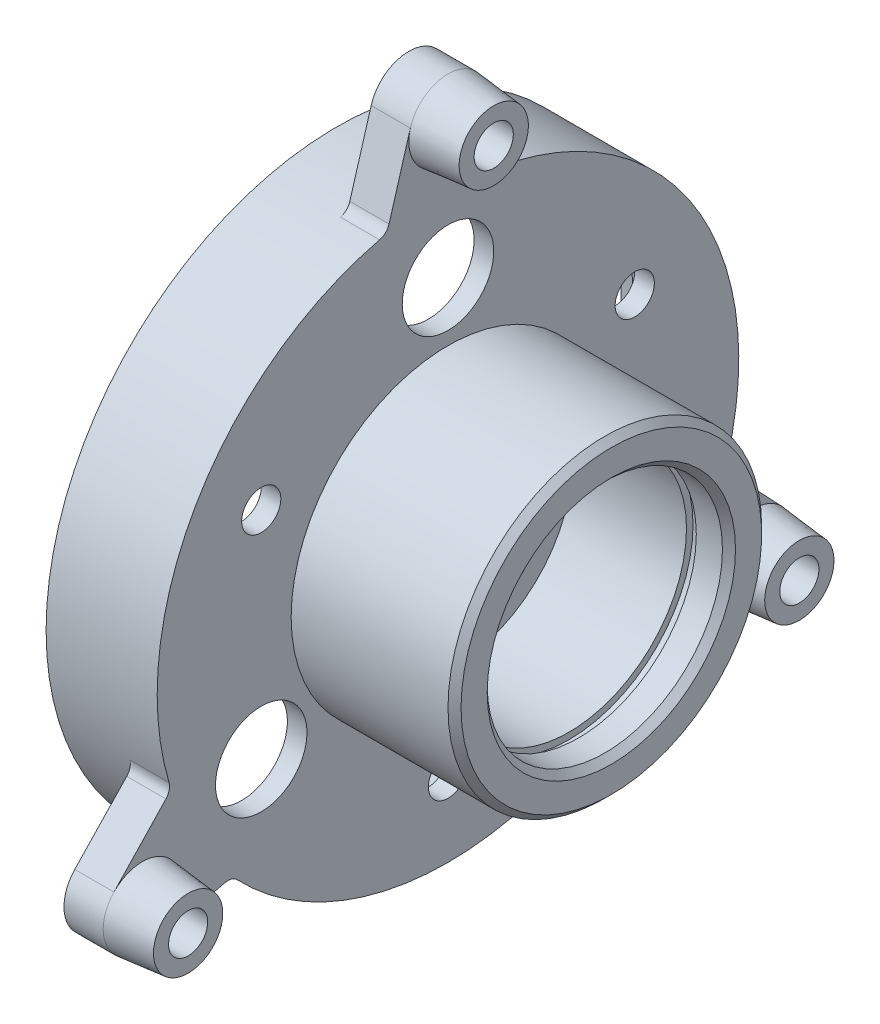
ISO-10303-21;
HEADER;
FILE_DESCRIPTION(('STEP AP214'),'2;1');
FILE_NAME('part.step','',(''),(''),'','','');
FILE_SCHEMA(('AUTOMOTIVE_DESIGN { 1 0 10303 214 1 1 1 1 }'));
ENDSEC;
DATA;
#1=APPLICATION_CONTEXT('core data for automotive mechanical design processes');
#2=APPLICATION_PROTOCOL_DEFINITION('international standard','automotive_design',2000,#1);
#3=PRODUCT_CONTEXT('',#1,'mechanical');
#4=PRODUCT('Part','Part','',(#3));
#5=PRODUCT_RELATED_PRODUCT_CATEGORY('part','',(#4));
#6=PRODUCT_DEFINITION_FORMATION('','',#4);
#7=PRODUCT_DEFINITION_CONTEXT('part definition',#1,'design');
#8=PRODUCT_DEFINITION('design','',#6,#7);
#9=PRODUCT_DEFINITION_SHAPE('','',#8);
#10=(LENGTH_UNIT() NAMED_UNIT(*) SI_UNIT(.MILLI.,.METRE.));
#11=(NAMED_UNIT(*) PLANE_ANGLE_UNIT() SI_UNIT($,.RADIAN.));
#12=(NAMED_UNIT(*) SI_UNIT($,.STERADIAN.) SOLID_ANGLE_UNIT());
#13=UNCERTAINTY_MEASURE_WITH_UNIT(LENGTH_MEASURE(1.E-05),#10,'distance_accuracy_value','');
#14=(GEOMETRIC_REPRESENTATION_CONTEXT(3) GLOBAL_UNCERTAINTY_ASSIGNED_CONTEXT((#13)) GLOBAL_UNIT_ASSIGNED_CONTEXT((#10,
#11,#12)) REPRESENTATION_CONTEXT('',''));
#15=CARTESIAN_POINT('',(0.,0.,0.));
#16=DIRECTION('',(0.,0.,1.));
#17=DIRECTION('',(1.,0.,0.));
#18=AXIS2_PLACEMENT_3D('',#15,#16,#17);
#19=CARTESIAN_POINT('',(42.,0.,0.));
#20=DIRECTION('',(-1.,0.,0.));
#21=DIRECTION('',(0.,0.,1.));
#22=AXIS2_PLACEMENT_3D('',#19,#20,#21);
#23=CYLINDRICAL_SURFACE('',#22,18.);
#24=CARTESIAN_POINT('',(18.,0.,0.));
#25=DIRECTION('',(-1.,0.,0.));
#26=DIRECTION('',(0.,0.,1.));
#27=AXIS2_PLACEMENT_3D('',#24,#25,#26);
#28=CIRCLE('',#27,18.);
#29=CARTESIAN_POINT('',(18.,0.,18.));
#30=VERTEX_POINT('',#29);
#31=EDGE_CURVE('E338',#30,#30,#28,.T.);
#32=ORIENTED_EDGE('',*,*,#31,.T.);
#33=EDGE_LOOP('',(#32));
#34=FACE_BOUND('',#33,.T.);
#35=CARTESIAN_POINT('',(35.5,0.,0.));
#36=DIRECTION('',(1.,0.,0.));
#37=DIRECTION('',(0.,0.,-1.));
#38=AXIS2_PLACEMENT_3D('',#35,#36,#37);
#39=CIRCLE('',#38,18.);
#40=CARTESIAN_POINT('',(35.5,0.,-18.));
#41=VERTEX_POINT('',#40);
#42=EDGE_CURVE('E31',#41,#41,#39,.F.);
#43=ORIENTED_EDGE('',*,*,#42,.F.);
#44=EDGE_LOOP('',(#43));
#45=FACE_BOUND('',#44,.T.);
#46=ADVANCED_FACE('F27',(#34,#45),#23,.F.);
#47=CARTESIAN_POINT('',(14.,0.,0.));
#48=DIRECTION('',(-1.,0.,0.));
#49=DIRECTION('',(0.,0.,1.));
#50=AXIS2_PLACEMENT_3D('',#47,#48,#49);
#51=CYLINDRICAL_SURFACE('',#50,42.5);
#52=CARTESIAN_POINT('',(14.,0.,0.));
#53=DIRECTION('',(-1.,0.,0.));
#54=DIRECTION('',(0.,0.,1.));
#55=AXIS2_PLACEMENT_3D('',#52,#53,#54);
#56=CIRCLE('',#55,42.5);
#57=CARTESIAN_POINT('',(14.,0.,42.5));
#58=VERTEX_POINT('',#57);
#59=EDGE_CURVE('E404',#58,#58,#56,.T.);
#60=ORIENTED_EDGE('',*,*,#59,.F.);
#61=EDGE_LOOP('',(#60));
#62=FACE_BOUND('',#61,.T.);
#63=CARTESIAN_POINT('',(3.,0.,0.));
#64=DIRECTION('',(-1.,0.,0.));
#65=DIRECTION('',(0.,0.,1.));
#66=AXIS2_PLACEMENT_3D('',#63,#64,#65);
#67=CIRCLE('',#66,42.5);
#68=CARTESIAN_POINT('',(3.,0.,42.5));
#69=VERTEX_POINT('',#68);
#70=EDGE_CURVE('E335',#69,#69,#67,.F.);
#71=ORIENTED_EDGE('',*,*,#70,.F.);
#72=EDGE_LOOP('',(#71));
#73=FACE_BOUND('',#72,.T.);
#74=ADVANCED_FACE('F485',(#62,#73),#51,.F.);
#75=CARTESIAN_POINT('',(17.,44.5,0.));
#76=DIRECTION('',(-1.,0.,0.));
#77=DIRECTION('',(0.,0.,1.));
#78=AXIS2_PLACEMENT_3D('',#75,#76,#77);
#79=PLANE('',#78);
#80=CARTESIAN_POINT('',(17.,16.4999999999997,28.5788383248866));
#81=DIRECTION('',(-1.,0.,0.));
#82=DIRECTION('',(0.,0.,1.));
#83=AXIS2_PLACEMENT_3D('',#80,#81,#82);
#84=CIRCLE('',#83,3.);
#85=CARTESIAN_POINT('',(17.,16.4999999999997,31.5788383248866));
#86=VERTEX_POINT('',#85);
#87=EDGE_CURVE('E358',#86,#86,#84,.T.);
#88=ORIENTED_EDGE('',*,*,#87,.T.);
#89=EDGE_LOOP('',(#88));
#90=FACE_BOUND('',#89,.T.);
#91=CARTESIAN_POINT('',(17.,-16.4999999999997,-28.5788383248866));
#92=DIRECTION('',(-1.,0.,0.));
#93=DIRECTION('',(0.,0.,1.));
#94=AXIS2_PLACEMENT_3D('',#91,#92,#93);
#95=CIRCLE('',#94,7.);
#96=CARTESIAN_POINT('',(17.,-16.4999999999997,-21.5788383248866));
#97=VERTEX_POINT('',#96);
#98=EDGE_CURVE('E364',#97,#97,#95,.T.);
#99=ORIENTED_EDGE('',*,*,#98,.T.);
#100=EDGE_LOOP('',(#99));
#101=FACE_BOUND('',#100,.T.);
#102=CARTESIAN_POINT('',(17.,16.5000000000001,-28.5788383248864));
#103=DIRECTION('',(-1.,0.,0.));
#104=DIRECTION('',(0.,0.,1.));
#105=AXIS2_PLACEMENT_3D('',#102,#103,#104);
#106=CIRCLE('',#105,3.);
#107=CARTESIAN_POINT('',(17.,16.5000000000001,-25.5788383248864));
#108=VERTEX_POINT('',#107);
#109=EDGE_CURVE('E370',#108,#108,#106,.T.);
#110=ORIENTED_EDGE('',*,*,#109,.T.);
#111=EDGE_LOOP('',(#110));
#112=FACE_BOUND('',#111,.T.);
#113=CARTESIAN_POINT('',(17.,-16.5000000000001,28.5788383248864));
#114=DIRECTION('',(-1.,0.,0.));
#115=DIRECTION('',(0.,0.,1.));
#116=AXIS2_PLACEMENT_3D('',#113,#114,#115);
#117=CIRCLE('',#116,7.);
#118=CARTESIAN_POINT('',(17.,-16.5000000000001,35.5788383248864));
#119=VERTEX_POINT('',#118);
#120=EDGE_CURVE('E376',#119,#119,#117,.T.);
#121=ORIENTED_EDGE('',*,*,#120,.T.);
#122=EDGE_LOOP('',(#121));
#123=FACE_BOUND('',#122,.T.);
#124=CARTESIAN_POINT('',(17.,-33.,0.));
#125=DIRECTION('',(-1.,0.,0.));
#126=DIRECTION('',(0.,0.,1.));
#127=AXIS2_PLACEMENT_3D('',#124,#125,#126);
#128=CIRCLE('',#127,3.);
#129=CARTESIAN_POINT('',(17.,-33.,3.));
#130=VERTEX_POINT('',#129);
#131=EDGE_CURVE('E382',#130,#130,#128,.T.);
#132=ORIENTED_EDGE('',*,*,#131,.T.);
#133=EDGE_LOOP('',(#132));
#134=FACE_BOUND('',#133,.T.);
#135=CARTESIAN_POINT('',(17.,33.,0.));
#136=DIRECTION('',(-1.,0.,0.));
#137=DIRECTION('',(0.,0.,1.));
#138=AXIS2_PLACEMENT_3D('',#135,#136,#137);
#139=CIRCLE('',#138,7.);
#140=CARTESIAN_POINT('',(17.,33.,7.));
#141=VERTEX_POINT('',#140);
#142=EDGE_CURVE('E388',#141,#141,#139,.T.);
#143=ORIENTED_EDGE('',*,*,#142,.T.);
#144=EDGE_LOOP('',(#143));
#145=FACE_BOUND('',#144,.T.);
#146=CARTESIAN_POINT('',(17.,0.,0.));
#147=DIRECTION('',(-1.,0.,0.));
#148=DIRECTION('',(0.,0.,1.));
#149=AXIS2_PLACEMENT_3D('',#146,#147,#148);
#150=CIRCLE('',#149,24.);
#151=CARTESIAN_POINT('',(17.,0.,24.));
#152=VERTEX_POINT('',#151);
#153=EDGE_CURVE('E254',#152,#152,#150,.T.);
#154=ORIENTED_EDGE('',*,*,#153,.T.);
#155=EDGE_LOOP('',(#154));
#156=FACE_BOUND('',#155,.T.);
#157=CARTESIAN_POINT('',(17.,-26.9999999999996,-46.7653718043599));
#158=DIRECTION('',(-1.,0.,0.));
#159=DIRECTION('',(0.,0.866025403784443,-0.499999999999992));
#160=AXIS2_PLACEMENT_3D('',#157,#158,#159);
#161=CIRCLE('',#160,6.);
#162=CARTESIAN_POINT('',(17.,-32.8327416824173,-45.3585582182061));
#163=VERTEX_POINT('',#162);
#164=CARTESIAN_POINT('',(17.,-22.8652928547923,-51.113267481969));
#165=VERTEX_POINT('',#164);
#166=EDGE_CURVE('E178',#163,#165,#161,.T.);
#167=ORIENTED_EDGE('',*,*,#166,.T.);
#168=DIRECTION('',(0.,0.724649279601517,0.689117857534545));
#169=VECTOR('',#168,1.);
#170=CARTESIAN_POINT('',(17.,-22.8652928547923,-51.113267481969));
#171=LINE('',#170,#169);
#172=CARTESIAN_POINT('',(17.,-14.5022067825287,-43.1602450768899));
#173=VERTEX_POINT('',#172);
#174=EDGE_CURVE('E153',#165,#173,#171,.T.);
#175=ORIENTED_EDGE('',*,*,#174,.T.);
#176=CARTESIAN_POINT('',(17.,-13.1239710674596,-44.609543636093));
#177=DIRECTION('',(-1.,0.,0.));
#178=DIRECTION('',(0.,0.,1.));
#179=AXIS2_PLACEMENT_3D('',#176,#177,#178);
#180=CIRCLE('',#179,2.);
#181=CARTESIAN_POINT('',(17.,-12.5594991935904,-42.6908535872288));
#182=VERTEX_POINT('',#181);
#183=EDGE_CURVE('E323',#173,#182,#180,.T.);
#184=ORIENTED_EDGE('',*,*,#183,.T.);
#185=CARTESIAN_POINT('',(17.,0.,0.));
#186=DIRECTION('',(-1.,0.,0.));
#187=DIRECTION('',(0.,0.,1.));
#188=AXIS2_PLACEMENT_3D('',#185,#186,#187);
#189=CIRCLE('',#188,44.5);
#190=CARTESIAN_POINT('',(17.,43.2511133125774,-10.4685814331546));
#191=VERTEX_POINT('',#190);
#192=EDGE_CURVE('E260',#191,#182,#189,.T.);
#193=ORIENTED_EDGE('',*,*,#192,.F.);
#194=CARTESIAN_POINT('',(17.,45.1949835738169,-10.9390794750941));
#195=DIRECTION('',(-1.,0.,0.));
#196=DIRECTION('',(0.,0.,1.));
#197=AXIS2_PLACEMENT_3D('',#194,#195,#196);
#198=CIRCLE('',#197,2.);
#199=CARTESIAN_POINT('',(17.,44.6289720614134,-9.02084305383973));
#200=VERTEX_POINT('',#199);
#201=EDGE_CURVE('E284',#191,#200,#198,.T.);
#202=ORIENTED_EDGE('',*,*,#201,.T.);
#203=DIRECTION('',(0.,0.959118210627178,0.283005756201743));
#204=VECTOR('',#203,1.);
#205=CARTESIAN_POINT('',(17.,55.6980345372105,-5.75470926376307));
#206=LINE('',#205,#204);
#207=CARTESIAN_POINT('',(17.,55.6980345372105,-5.75470926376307));
#208=VERTEX_POINT('',#207);
#209=EDGE_CURVE('E240',#200,#208,#206,.T.);
#210=ORIENTED_EDGE('',*,*,#209,.T.);
#211=CARTESIAN_POINT('',(17.,54.,0.));
#212=DIRECTION('',(-1.,0.,0.));
#213=DIRECTION('',(0.,0.,1.));
#214=AXIS2_PLACEMENT_3D('',#211,#212,#213);
#215=CIRCLE('',#214,6.);
#216=CARTESIAN_POINT('',(17.,55.6980345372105,5.75470926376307));
#217=VERTEX_POINT('',#216);
#218=EDGE_CURVE('E228',#208,#217,#215,.T.);
#219=ORIENTED_EDGE('',*,*,#218,.T.);
#220=DIRECTION('',(0.,-0.959118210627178,0.283005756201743));
#221=VECTOR('',#220,1.);
#222=CARTESIAN_POINT('',(17.,55.6980345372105,5.75470926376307));
#223=LINE('',#222,#221);
#224=CARTESIAN_POINT('',(17.,44.6289720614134,9.02084305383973));
#225=VERTEX_POINT('',#224);
#226=EDGE_CURVE('E237',#217,#225,#223,.T.);
#227=ORIENTED_EDGE('',*,*,#226,.T.);
#228=CARTESIAN_POINT('',(17.,45.1949835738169,10.9390794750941));
#229=DIRECTION('',(-1.,0.,0.));
#230=DIRECTION('',(0.,0.,1.));
#231=AXIS2_PLACEMENT_3D('',#228,#229,#230);
#232=CIRCLE('',#231,2.);
#233=CARTESIAN_POINT('',(17.,43.2511133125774,10.4685814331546));
#234=VERTEX_POINT('',#233);
#235=EDGE_CURVE('E281',#225,#234,#232,.T.);
#236=ORIENTED_EDGE('',*,*,#235,.T.);
#237=CARTESIAN_POINT('',(17.,-12.559499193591,42.6908535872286));
#238=VERTEX_POINT('',#237);
#239=EDGE_CURVE('E259',#238,#234,#189,.T.);
#240=ORIENTED_EDGE('',*,*,#239,.F.);
#241=CARTESIAN_POINT('',(17.,-13.1239710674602,44.6095436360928));
#242=DIRECTION('',(-1.,0.,0.));
#243=DIRECTION('',(0.,0.,1.));
#244=AXIS2_PLACEMENT_3D('',#241,#242,#243);
#245=CIRCLE('',#244,2.);
#246=CARTESIAN_POINT('',(17.,-14.5022067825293,43.1602450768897));
#247=VERTEX_POINT('',#246);
#248=EDGE_CURVE('E308',#238,#247,#245,.T.);
#249=ORIENTED_EDGE('',*,*,#248,.T.);
#250=DIRECTION('',(0.,-0.724649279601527,0.689117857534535));
#251=VECTOR('',#250,1.);
#252=CARTESIAN_POINT('',(17.,-22.865292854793,51.1132674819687));
#253=LINE('',#252,#251);
#254=CARTESIAN_POINT('',(17.,-22.865292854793,51.1132674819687));
#255=VERTEX_POINT('',#254);
#256=EDGE_CURVE('E206',#247,#255,#253,.T.);
#257=ORIENTED_EDGE('',*,*,#256,.T.);
#258=CARTESIAN_POINT('',(17.,-27.0000000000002,46.7653718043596));
#259=DIRECTION('',(-1.,0.,0.));
#260=DIRECTION('',(0.,-0.866025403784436,-0.500000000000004));
#261=AXIS2_PLACEMENT_3D('',#258,#259,#260);
#262=CIRCLE('',#261,6.);
#263=CARTESIAN_POINT('',(17.,-32.8327416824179,45.3585582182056));
#264=VERTEX_POINT('',#263);
#265=EDGE_CURVE('E190',#255,#264,#262,.T.);
#266=ORIENTED_EDGE('',*,*,#265,.T.);
#267=DIRECTION('',(0.,0.234468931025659,-0.972123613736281));
#268=VECTOR('',#267,1.);
#269=CARTESIAN_POINT('',(17.,-32.8327416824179,45.3585582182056));
#270=LINE('',#269,#268);
#271=CARTESIAN_POINT('',(17.,-30.1267652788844,34.1394020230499));
#272=VERTEX_POINT('',#271);
#273=EDGE_CURVE('E203',#264,#272,#270,.T.);
#274=ORIENTED_EDGE('',*,*,#273,.T.);
#275=CARTESIAN_POINT('',(17.,-32.071012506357,33.6704641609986));
#276=DIRECTION('',(-1.,0.,0.));
#277=DIRECTION('',(0.,0.,1.));
#278=AXIS2_PLACEMENT_3D('',#275,#276,#277);
#279=CIRCLE('',#278,2.);
#280=CARTESIAN_POINT('',(17.,-30.6916141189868,32.2222721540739));
#281=VERTEX_POINT('',#280);
#282=EDGE_CURVE('E305',#272,#281,#279,.T.);
#283=ORIENTED_EDGE('',*,*,#282,.T.);
#284=CARTESIAN_POINT('',(17.,-30.6916141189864,-32.2222721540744));
#285=VERTEX_POINT('',#284);
#286=EDGE_CURVE('E264',#285,#281,#189,.T.);
#287=ORIENTED_EDGE('',*,*,#286,.F.);
#288=CARTESIAN_POINT('',(17.,-32.0710125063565,-33.6704641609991));
#289=DIRECTION('',(-1.,0.,0.));
#290=DIRECTION('',(0.,0.,1.));
#291=AXIS2_PLACEMENT_3D('',#288,#289,#290);
#292=CIRCLE('',#291,2.);
#293=CARTESIAN_POINT('',(17.,-30.126765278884,-34.1394020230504));
#294=VERTEX_POINT('',#293);
#295=EDGE_CURVE('E44',#285,#294,#292,.T.);
#296=ORIENTED_EDGE('',*,*,#295,.T.);
#297=DIRECTION('',(0.,-0.234468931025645,-0.972123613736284));
#298=VECTOR('',#297,1.);
#299=CARTESIAN_POINT('',(17.,-32.8327416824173,-45.3585582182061));
#300=LINE('',#299,#298);
#301=EDGE_CURVE('E163',#294,#163,#300,.T.);
#302=ORIENTED_EDGE('',*,*,#301,.T.);
#303=EDGE_LOOP('',(#167,#175,#184,#193,#202,#210,#219,#227,#236,#240,#249,#257,#266,#274,#283,
#287,#296,#302));
#304=FACE_BOUND('',#303,.T.);
#305=ADVANCED_FACE('F179',(#90,#101,#112,#123,#134,#145,#156,#304),#79,.F.);
#306=CARTESIAN_POINT('',(0.,0.,0.));
#307=DIRECTION('',(1.,0.,0.));
#308=DIRECTION('',(0.,0.,-1.));
#309=AXIS2_PLACEMENT_3D('',#306,#307,#308);
#310=PLANE('',#309);
#311=CARTESIAN_POINT('',(0.,0.,0.));
#312=DIRECTION('',(-1.,0.,0.));
#313=DIRECTION('',(0.,0.,1.));
#314=AXIS2_PLACEMENT_3D('',#311,#312,#313);
#315=CIRCLE('',#314,43.5);
#316=CARTESIAN_POINT('',(0.,0.,43.5));
#317=VERTEX_POINT('',#316);
#318=EDGE_CURVE('E391',#317,#317,#315,.T.);
#319=ORIENTED_EDGE('',*,*,#318,.F.);
#320=EDGE_LOOP('',(#319));
#321=FACE_BOUND('',#320,.T.);
#322=CARTESIAN_POINT('',(0.,0.,0.));
#323=DIRECTION('',(-1.,0.,0.));
#324=DIRECTION('',(0.,0.,1.));
#325=AXIS2_PLACEMENT_3D('',#322,#323,#324);
#326=CIRCLE('',#325,44.5);
#327=CARTESIAN_POINT('',(0.,0.,44.5));
#328=VERTEX_POINT('',#327);
#329=EDGE_CURVE('E263',#328,#328,#326,.T.);
#330=ORIENTED_EDGE('',*,*,#329,.T.);
#331=EDGE_LOOP('',(#330));
#332=FACE_BOUND('',#331,.T.);
#333=ADVANCED_FACE('F29',(#321,#332),#310,.F.);
#334=CARTESIAN_POINT('',(-39.9833636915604,0.,0.));
#335=DIRECTION('',(-1.,0.,0.));
#336=DIRECTION('',(0.,0.,1.));
#337=AXIS2_PLACEMENT_3D('',#334,#335,#336);
#338=CYLINDRICAL_SURFACE('',#337,44.5);
#339=ORIENTED_EDGE('',*,*,#329,.F.);
#340=EDGE_LOOP('',(#339));
#341=FACE_BOUND('',#340,.T.);
#342=ORIENTED_EDGE('',*,*,#192,.T.);
#343=DIRECTION('',(-1.,0.,0.));
#344=VECTOR('',#343,1.);
#345=CARTESIAN_POINT('',(-39.9833636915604,-12.5594991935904,-42.6908535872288));
#346=LINE('',#345,#344);
#347=CARTESIAN_POINT('',(11.,-12.5594991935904,-42.6908535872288));
#348=VERTEX_POINT('',#347);
#349=EDGE_CURVE('E316',#182,#348,#346,.T.);
#350=ORIENTED_EDGE('',*,*,#349,.T.);
#351=CARTESIAN_POINT('',(11.,0.,0.));
#352=DIRECTION('',(1.,0.,0.));
#353=DIRECTION('',(0.,0.,-1.));
#354=AXIS2_PLACEMENT_3D('',#351,#352,#353);
#355=CIRCLE('',#354,44.5);
#356=CARTESIAN_POINT('',(11.,-30.6916141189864,-32.2222721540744));
#357=VERTEX_POINT('',#356);
#358=EDGE_CURVE('E291',#357,#348,#355,.T.);
#359=ORIENTED_EDGE('',*,*,#358,.F.);
#360=DIRECTION('',(-1.,0.,0.));
#361=VECTOR('',#360,1.);
#362=CARTESIAN_POINT('',(-39.9833636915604,-30.6916141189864,-32.2222721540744));
#363=LINE('',#362,#361);
#364=EDGE_CURVE('E313',#357,#285,#363,.F.);
#365=ORIENTED_EDGE('',*,*,#364,.T.);
#366=ORIENTED_EDGE('',*,*,#286,.T.);
#367=DIRECTION('',(-1.,0.,0.));
#368=VECTOR('',#367,1.);
#369=CARTESIAN_POINT('',(-39.9833636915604,-30.6916141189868,32.2222721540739));
#370=LINE('',#369,#368);
#371=CARTESIAN_POINT('',(11.,-30.6916141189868,32.2222721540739));
#372=VERTEX_POINT('',#371);
#373=EDGE_CURVE('E296',#281,#372,#370,.T.);
#374=ORIENTED_EDGE('',*,*,#373,.T.);
#375=CARTESIAN_POINT('',(11.,0.,0.));
#376=DIRECTION('',(1.,0.,0.));
#377=DIRECTION('',(0.,0.,-1.));
#378=AXIS2_PLACEMENT_3D('',#375,#376,#377);
#379=CIRCLE('',#378,44.5);
#380=CARTESIAN_POINT('',(11.,-12.559499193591,42.6908535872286));
#381=VERTEX_POINT('',#380);
#382=EDGE_CURVE('E289',#381,#372,#379,.T.);
#383=ORIENTED_EDGE('',*,*,#382,.F.);
#384=DIRECTION('',(-1.,0.,0.));
#385=VECTOR('',#384,1.);
#386=CARTESIAN_POINT('',(-39.9833636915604,-12.559499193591,42.6908535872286));
#387=LINE('',#386,#385);
#388=EDGE_CURVE('E293',#381,#238,#387,.F.);
#389=ORIENTED_EDGE('',*,*,#388,.T.);
#390=ORIENTED_EDGE('',*,*,#239,.T.);
#391=DIRECTION('',(-1.,0.,0.));
#392=VECTOR('',#391,1.);
#393=CARTESIAN_POINT('',(-39.9833636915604,43.2511133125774,10.4685814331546));
#394=LINE('',#393,#392);
#395=CARTESIAN_POINT('',(11.,43.2511133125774,10.4685814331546));
#396=VERTEX_POINT('',#395);
#397=EDGE_CURVE('E272',#234,#396,#394,.T.);
#398=ORIENTED_EDGE('',*,*,#397,.T.);
#399=CARTESIAN_POINT('',(11.,0.,0.));
#400=DIRECTION('',(1.,0.,0.));
#401=DIRECTION('',(0.,0.,-1.));
#402=AXIS2_PLACEMENT_3D('',#399,#400,#401);
#403=CIRCLE('',#402,44.5);
#404=CARTESIAN_POINT('',(11.,43.2511133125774,-10.4685814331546));
#405=VERTEX_POINT('',#404);
#406=EDGE_CURVE('E267',#405,#396,#403,.T.);
#407=ORIENTED_EDGE('',*,*,#406,.F.);
#408=DIRECTION('',(-1.,0.,0.));
#409=VECTOR('',#408,1.);
#410=CARTESIAN_POINT('',(-39.9833636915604,43.2511133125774,-10.4685814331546));
#411=LINE('',#410,#409);
#412=EDGE_CURVE('E269',#405,#191,#411,.F.);
#413=ORIENTED_EDGE('',*,*,#412,.T.);
#414=EDGE_LOOP('',(#342,#350,#359,#365,#366,#374,#383,#389,#390,#398,#407,#413));
#415=FACE_BOUND('',#414,.T.);
#416=ADVANCED_FACE('F443',(#341,#415),#338,.T.);
#417=CARTESIAN_POINT('',(-39.9833636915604,0.,0.));
#418=DIRECTION('',(-1.,0.,0.));
#419=DIRECTION('',(0.,0.,1.));
#420=AXIS2_PLACEMENT_3D('',#417,#418,#419);
#421=CYLINDRICAL_SURFACE('',#420,24.);
#422=CARTESIAN_POINT('',(41.,0.,0.));
#423=DIRECTION('',(-1.,0.,0.));
#424=DIRECTION('',(0.,0.,1.));
#425=AXIS2_PLACEMENT_3D('',#422,#423,#424);
#426=CIRCLE('',#425,24.);
#427=CARTESIAN_POINT('',(41.,0.,24.));
#428=VERTEX_POINT('',#427);
#429=EDGE_CURVE('E329',#428,#428,#426,.T.);
#430=ORIENTED_EDGE('',*,*,#429,.T.);
#431=EDGE_LOOP('',(#430));
#432=FACE_BOUND('',#431,.T.);
#433=ORIENTED_EDGE('',*,*,#153,.F.);
#434=EDGE_LOOP('',(#433));
#435=FACE_BOUND('',#434,.T.);
#436=ADVANCED_FACE('F524',(#432,#435),#421,.T.);
#437=CARTESIAN_POINT('',(42.,24.,0.));
#438=DIRECTION('',(-1.,0.,0.));
#439=DIRECTION('',(0.,0.,1.));
#440=AXIS2_PLACEMENT_3D('',#437,#438,#439);
#441=PLANE('',#440);
#442=CARTESIAN_POINT('',(42.,0.,0.));
#443=DIRECTION('',(-1.,0.,0.));
#444=DIRECTION('',(0.,0.,1.));
#445=AXIS2_PLACEMENT_3D('',#442,#443,#444);
#446=CIRCLE('',#445,19.);
#447=CARTESIAN_POINT('',(42.,0.,19.));
#448=VERTEX_POINT('',#447);
#449=EDGE_CURVE('E36',#448,#448,#446,.T.);
#450=ORIENTED_EDGE('',*,*,#449,.T.);
#451=EDGE_LOOP('',(#450));
#452=FACE_BOUND('',#451,.T.);
#453=CARTESIAN_POINT('',(42.,0.,0.));
#454=DIRECTION('',(-1.,0.,0.));
#455=DIRECTION('',(0.,0.,1.));
#456=AXIS2_PLACEMENT_3D('',#453,#454,#455);
#457=CIRCLE('',#456,23.);
#458=CARTESIAN_POINT('',(42.,0.,23.));
#459=VERTEX_POINT('',#458);
#460=EDGE_CURVE('E332',#459,#459,#457,.F.);
#461=ORIENTED_EDGE('',*,*,#460,.T.);
#462=EDGE_LOOP('',(#461));
#463=FACE_BOUND('',#462,.T.);
#464=ADVANCED_FACE('F521',(#452,#463),#441,.F.);
#465=CARTESIAN_POINT('',(11.,54.,0.));
#466=DIRECTION('',(1.,0.,0.));
#467=DIRECTION('',(0.,0.,-1.));
#468=AXIS2_PLACEMENT_3D('',#465,#466,#467);
#469=PLANE('',#468);
#470=CARTESIAN_POINT('',(11.,54.,0.));
#471=DIRECTION('',(1.,0.,0.));
#472=DIRECTION('',(0.,0.,-1.));
#473=AXIS2_PLACEMENT_3D('',#470,#471,#472);
#474=CIRCLE('',#473,3.);
#475=CARTESIAN_POINT('',(11.,54.,-3.));
#476=VERTEX_POINT('',#475);
#477=EDGE_CURVE('E225',#476,#476,#474,.T.);
#478=ORIENTED_EDGE('',*,*,#477,.T.);
#479=EDGE_LOOP('',(#478));
#480=FACE_BOUND('',#479,.T.);
#481=DIRECTION('',(0.,0.959118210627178,0.283005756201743));
#482=VECTOR('',#481,1.);
#483=CARTESIAN_POINT('',(11.,55.6980345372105,-5.75470926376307));
#484=LINE('',#483,#482);
#485=CARTESIAN_POINT('',(11.,44.6289720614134,-9.02084305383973));
#486=VERTEX_POINT('',#485);
#487=CARTESIAN_POINT('',(11.,55.6980345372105,-5.75470926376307));
#488=VERTEX_POINT('',#487);
#489=EDGE_CURVE('E248',#486,#488,#484,.T.);
#490=ORIENTED_EDGE('',*,*,#489,.F.);
#491=CARTESIAN_POINT('',(11.,45.1949835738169,-10.9390794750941));
#492=DIRECTION('',(1.,0.,0.));
#493=DIRECTION('',(0.,0.,-1.));
#494=AXIS2_PLACEMENT_3D('',#491,#492,#493);
#495=CIRCLE('',#494,2.);
#496=EDGE_CURVE('E286',#486,#405,#495,.T.);
#497=ORIENTED_EDGE('',*,*,#496,.T.);
#498=ORIENTED_EDGE('',*,*,#406,.T.);
#499=CARTESIAN_POINT('',(11.,45.1949835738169,10.9390794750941));
#500=DIRECTION('',(1.,0.,0.));
#501=DIRECTION('',(0.,0.,-1.));
#502=AXIS2_PLACEMENT_3D('',#499,#500,#501);
#503=CIRCLE('',#502,2.);
#504=CARTESIAN_POINT('',(11.,44.6289720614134,9.02084305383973));
#505=VERTEX_POINT('',#504);
#506=EDGE_CURVE('E279',#396,#505,#503,.T.);
#507=ORIENTED_EDGE('',*,*,#506,.T.);
#508=DIRECTION('',(0.,-0.959118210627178,0.283005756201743));
#509=VECTOR('',#508,1.);
#510=CARTESIAN_POINT('',(11.,55.6980345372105,5.75470926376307));
#511=LINE('',#510,#509);
#512=CARTESIAN_POINT('',(11.,55.6980345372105,5.75470926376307));
#513=VERTEX_POINT('',#512);
#514=EDGE_CURVE('E245',#513,#505,#511,.T.);
#515=ORIENTED_EDGE('',*,*,#514,.F.);
#516=CARTESIAN_POINT('',(11.,54.,0.));
#517=DIRECTION('',(1.,0.,0.));
#518=DIRECTION('',(0.,0.,-1.));
#519=AXIS2_PLACEMENT_3D('',#516,#517,#518);
#520=CIRCLE('',#519,6.);
#521=EDGE_CURVE('E242',#488,#513,#520,.T.);
#522=ORIENTED_EDGE('',*,*,#521,.F.);
#523=EDGE_LOOP('',(#490,#497,#498,#507,#515,#522));
#524=FACE_BOUND('',#523,.T.);
#525=ADVANCED_FACE('F456',(#480,#524),#469,.F.);
#526=CARTESIAN_POINT('',(11.,55.6980345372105,-5.75470926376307));
#527=DIRECTION('',(0.,0.283005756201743,-0.959118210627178));
#528=DIRECTION('',(0.,0.959118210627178,0.283005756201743));
#529=AXIS2_PLACEMENT_3D('',#526,#527,#528);
#530=PLANE('',#529);
#531=ORIENTED_EDGE('',*,*,#209,.F.);
#532=DIRECTION('',(-1.,0.,0.));
#533=VECTOR('',#532,1.);
#534=CARTESIAN_POINT('',(11.,44.6289720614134,-9.02084305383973));
#535=LINE('',#534,#533);
#536=EDGE_CURVE('E277',#200,#486,#535,.T.);
#537=ORIENTED_EDGE('',*,*,#536,.T.);
#538=ORIENTED_EDGE('',*,*,#489,.T.);
#539=DIRECTION('',(1.,0.,0.));
#540=VECTOR('',#539,1.);
#541=CARTESIAN_POINT('',(11.,55.6980345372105,-5.75470926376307));
#542=LINE('',#541,#540);
#543=EDGE_CURVE('E251',#488,#208,#542,.T.);
#544=ORIENTED_EDGE('',*,*,#543,.T.);
#545=EDGE_LOOP('',(#531,#537,#538,#544));
#546=FACE_BOUND('',#545,.T.);
#547=ADVANCED_FACE('F817',(#546),#530,.T.);
#548=CARTESIAN_POINT('',(11.,55.6980345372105,5.75470926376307));
#549=DIRECTION('',(0.,0.283005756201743,0.959118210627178));
#550=DIRECTION('',(0.,-0.959118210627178,0.283005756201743));
#551=AXIS2_PLACEMENT_3D('',#548,#549,#550);
#552=PLANE('',#551);
#553=ORIENTED_EDGE('',*,*,#514,.T.);
#554=DIRECTION('',(-1.,0.,0.));
#555=VECTOR('',#554,1.);
#556=CARTESIAN_POINT('',(11.,44.6289720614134,9.02084305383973));
#557=LINE('',#556,#555);
#558=EDGE_CURVE('E275',#505,#225,#557,.F.);
#559=ORIENTED_EDGE('',*,*,#558,.T.);
#560=ORIENTED_EDGE('',*,*,#226,.F.);
#561=DIRECTION('',(1.,0.,0.));
#562=VECTOR('',#561,1.);
#563=CARTESIAN_POINT('',(11.,55.6980345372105,5.75470926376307));
#564=LINE('',#563,#562);
#565=EDGE_CURVE('E250',#513,#217,#564,.T.);
#566=ORIENTED_EDGE('',*,*,#565,.F.);
#567=EDGE_LOOP('',(#553,#559,#560,#566));
#568=FACE_BOUND('',#567,.T.);
#569=ADVANCED_FACE('F459',(#568),#552,.T.);
#570=CARTESIAN_POINT('',(11.,54.,0.));
#571=DIRECTION('',(1.,0.,0.));
#572=DIRECTION('',(0.,0.,-1.));
#573=AXIS2_PLACEMENT_3D('',#570,#571,#572);
#574=CYLINDRICAL_SURFACE('',#573,6.);
#575=CARTESIAN_POINT('',(17.,54.,0.));
#576=DIRECTION('',(1.,0.,0.));
#577=DIRECTION('',(0.,0.,-1.));
#578=AXIS2_PLACEMENT_3D('',#575,#576,#577);
#579=CIRCLE('',#578,6.);
#580=EDGE_CURVE('E234',#208,#217,#579,.T.);
#581=ORIENTED_EDGE('',*,*,#580,.F.);
#582=ORIENTED_EDGE('',*,*,#543,.F.);
#583=ORIENTED_EDGE('',*,*,#521,.T.);
#584=ORIENTED_EDGE('',*,*,#565,.T.);
#585=EDGE_LOOP('',(#581,#582,#583,#584));
#586=FACE_BOUND('',#585,.T.);
#587=ADVANCED_FACE('F462',(#586),#574,.T.);
#588=CARTESIAN_POINT('',(24.,54.,0.));
#589=DIRECTION('',(-1.,0.,0.));
#590=DIRECTION('',(0.,0.,1.));
#591=AXIS2_PLACEMENT_3D('',#588,#589,#590);
#592=CONICAL_SURFACE('',#591,5.30155448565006,0.099448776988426);
#593=ORIENTED_EDGE('',*,*,#580,.T.);
#594=ORIENTED_EDGE('',*,*,#218,.F.);
#595=EDGE_LOOP('',(#593,#594));
#596=FACE_BOUND('',#595,.T.);
#597=CARTESIAN_POINT('',(24.,54.,0.));
#598=DIRECTION('',(-1.,0.,0.));
#599=DIRECTION('',(0.,0.,1.));
#600=AXIS2_PLACEMENT_3D('',#597,#598,#599);
#601=CIRCLE('',#600,5.30155448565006);
#602=CARTESIAN_POINT('',(24.,54.,5.30155448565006));
#603=VERTEX_POINT('',#602);
#604=EDGE_CURVE('E231',#603,#603,#601,.T.);
#605=ORIENTED_EDGE('',*,*,#604,.T.);
#606=EDGE_LOOP('',(#605));
#607=FACE_BOUND('',#606,.T.);
#608=ADVANCED_FACE('F467',(#596,#607),#592,.T.);
#609=CARTESIAN_POINT('',(24.,59.3015544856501,0.));
#610=DIRECTION('',(-1.,0.,0.));
#611=DIRECTION('',(0.,0.,1.));
#612=AXIS2_PLACEMENT_3D('',#609,#610,#611);
#613=PLANE('',#612);
#614=CARTESIAN_POINT('',(24.,54.,0.));
#615=DIRECTION('',(1.,0.,0.));
#616=DIRECTION('',(0.,0.,-1.));
#617=AXIS2_PLACEMENT_3D('',#614,#615,#616);
#618=CIRCLE('',#617,3.);
#619=CARTESIAN_POINT('',(24.,54.,-3.));
#620=VERTEX_POINT('',#619);
#621=EDGE_CURVE('E220',#620,#620,#618,.T.);
#622=ORIENTED_EDGE('',*,*,#621,.F.);
#623=EDGE_LOOP('',(#622));
#624=FACE_BOUND('',#623,.T.);
#625=ORIENTED_EDGE('',*,*,#604,.F.);
#626=EDGE_LOOP('',(#625));
#627=FACE_BOUND('',#626,.T.);
#628=ADVANCED_FACE('F470',(#624,#627),#613,.F.);
#629=CARTESIAN_POINT('',(0.,54.,0.));
#630=DIRECTION('',(1.,0.,0.));
#631=DIRECTION('',(0.,0.,-1.));
#632=AXIS2_PLACEMENT_3D('',#629,#630,#631);
#633=CYLINDRICAL_SURFACE('',#632,3.);
#634=ORIENTED_EDGE('',*,*,#621,.T.);
#635=EDGE_LOOP('',(#634));
#636=FACE_BOUND('',#635,.T.);
#637=ORIENTED_EDGE('',*,*,#477,.F.);
#638=EDGE_LOOP('',(#637));
#639=FACE_BOUND('',#638,.T.);
#640=ADVANCED_FACE('F475',(#636,#639),#633,.F.);
#641=CARTESIAN_POINT('',(-39.9833636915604,45.1949835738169,10.9390794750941));
#642=DIRECTION('',(-1.,0.,0.));
#643=DIRECTION('',(0.,0.,1.));
#644=AXIS2_PLACEMENT_3D('',#641,#642,#643);
#645=CYLINDRICAL_SURFACE('',#644,2.);
#646=ORIENTED_EDGE('',*,*,#235,.F.);
#647=ORIENTED_EDGE('',*,*,#558,.F.);
#648=ORIENTED_EDGE('',*,*,#506,.F.);
#649=ORIENTED_EDGE('',*,*,#397,.F.);
#650=EDGE_LOOP('',(#646,#647,#648,#649));
#651=FACE_BOUND('',#650,.T.);
#652=ADVANCED_FACE('F452',(#651),#645,.F.);
#653=CARTESIAN_POINT('',(-39.9833636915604,45.1949835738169,-10.9390794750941));
#654=DIRECTION('',(-1.,0.,0.));
#655=DIRECTION('',(0.,0.,1.));
#656=AXIS2_PLACEMENT_3D('',#653,#654,#655);
#657=CYLINDRICAL_SURFACE('',#656,2.);
#658=ORIENTED_EDGE('',*,*,#496,.F.);
#659=ORIENTED_EDGE('',*,*,#536,.F.);
#660=ORIENTED_EDGE('',*,*,#201,.F.);
#661=ORIENTED_EDGE('',*,*,#412,.F.);
#662=EDGE_LOOP('',(#658,#659,#660,#661));
#663=FACE_BOUND('',#662,.T.);
#664=ADVANCED_FACE('F563',(#663),#657,.F.);
#665=CARTESIAN_POINT('',(11.,-22.865292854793,51.1132674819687));
#666=DIRECTION('',(0.,0.689117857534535,0.724649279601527));
#667=DIRECTION('',(0.,-0.724649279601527,0.689117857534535));
#668=AXIS2_PLACEMENT_3D('',#665,#666,#667);
#669=PLANE('',#668);
#670=ORIENTED_EDGE('',*,*,#256,.F.);
#671=DIRECTION('',(-1.,0.,0.));
#672=VECTOR('',#671,1.);
#673=CARTESIAN_POINT('',(11.,-14.5022067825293,43.1602450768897));
#674=LINE('',#673,#672);
#675=CARTESIAN_POINT('',(11.,-14.5022067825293,43.1602450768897));
#676=VERTEX_POINT('',#675);
#677=EDGE_CURVE('E301',#247,#676,#674,.T.);
#678=ORIENTED_EDGE('',*,*,#677,.T.);
#679=DIRECTION('',(0.,-0.724649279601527,0.689117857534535));
#680=VECTOR('',#679,1.);
#681=CARTESIAN_POINT('',(11.,-22.865292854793,51.1132674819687));
#682=LINE('',#681,#680);
#683=CARTESIAN_POINT('',(11.,-22.865292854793,51.1132674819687));
#684=VERTEX_POINT('',#683);
#685=EDGE_CURVE('E214',#676,#684,#682,.T.);
#686=ORIENTED_EDGE('',*,*,#685,.T.);
#687=DIRECTION('',(1.,0.,0.));
#688=VECTOR('',#687,1.);
#689=CARTESIAN_POINT('',(11.,-22.865292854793,51.1132674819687));
#690=LINE('',#689,#688);
#691=EDGE_CURVE('E217',#684,#255,#690,.T.);
#692=ORIENTED_EDGE('',*,*,#691,.T.);
#693=EDGE_LOOP('',(#670,#678,#686,#692));
#694=FACE_BOUND('',#693,.T.);
#695=ADVANCED_FACE('F567',(#694),#669,.T.);
#696=CARTESIAN_POINT('',(11.,-32.8327416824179,45.3585582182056));
#697=DIRECTION('',(0.,-0.97212361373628,-0.234468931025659));
#698=DIRECTION('',(0.,0.234468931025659,-0.972123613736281));
#699=AXIS2_PLACEMENT_3D('',#696,#697,#698);
#700=PLANE('',#699);
#701=DIRECTION('',(0.,0.234468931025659,-0.972123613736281));
#702=VECTOR('',#701,1.);
#703=CARTESIAN_POINT('',(11.,-32.8327416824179,45.3585582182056));
#704=LINE('',#703,#702);
#705=CARTESIAN_POINT('',(11.,-32.8327416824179,45.3585582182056));
#706=VERTEX_POINT('',#705);
#707=CARTESIAN_POINT('',(11.,-30.1267652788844,34.1394020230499));
#708=VERTEX_POINT('',#707);
#709=EDGE_CURVE('E211',#706,#708,#704,.T.);
#710=ORIENTED_EDGE('',*,*,#709,.T.);
#711=DIRECTION('',(-1.,0.,0.));
#712=VECTOR('',#711,1.);
#713=CARTESIAN_POINT('',(11.,-30.1267652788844,34.1394020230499));
#714=LINE('',#713,#712);
#715=EDGE_CURVE('E299',#708,#272,#714,.F.);
#716=ORIENTED_EDGE('',*,*,#715,.T.);
#717=ORIENTED_EDGE('',*,*,#273,.F.);
#718=DIRECTION('',(1.,0.,0.));
#719=VECTOR('',#718,1.);
#720=CARTESIAN_POINT('',(11.,-32.8327416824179,45.3585582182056));
#721=LINE('',#720,#719);
#722=EDGE_CURVE('E216',#706,#264,#721,.T.);
#723=ORIENTED_EDGE('',*,*,#722,.F.);
#724=EDGE_LOOP('',(#710,#716,#717,#723));
#725=FACE_BOUND('',#724,.T.);
#726=ADVANCED_FACE('F433',(#725),#700,.T.);
#727=CARTESIAN_POINT('',(11.,-27.0000000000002,46.7653718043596));
#728=DIRECTION('',(1.,0.,0.));
#729=DIRECTION('',(0.,0.866025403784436,0.500000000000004));
#730=AXIS2_PLACEMENT_3D('',#727,#728,#729);
#731=PLANE('',#730);
#732=CARTESIAN_POINT('',(11.,-27.0000000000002,46.7653718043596));
#733=DIRECTION('',(1.,0.,0.));
#734=DIRECTION('',(0.,0.,-1.));
#735=AXIS2_PLACEMENT_3D('',#732,#733,#734);
#736=CIRCLE('',#735,3.);
#737=CARTESIAN_POINT('',(11.,-27.0000000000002,43.7653718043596));
#738=VERTEX_POINT('',#737);
#739=EDGE_CURVE('E183',#738,#738,#736,.T.);
#740=ORIENTED_EDGE('',*,*,#739,.T.);
#741=EDGE_LOOP('',(#740));
#742=FACE_BOUND('',#741,.T.);
#743=ORIENTED_EDGE('',*,*,#685,.F.);
#744=CARTESIAN_POINT('',(11.,-13.1239710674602,44.6095436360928));
#745=DIRECTION('',(1.,0.,0.));
#746=DIRECTION('',(0.,0.,-1.));
#747=AXIS2_PLACEMENT_3D('',#744,#745,#746);
#748=CIRCLE('',#747,2.);
#749=EDGE_CURVE('E310',#676,#381,#748,.T.);
#750=ORIENTED_EDGE('',*,*,#749,.T.);
#751=ORIENTED_EDGE('',*,*,#382,.T.);
#752=CARTESIAN_POINT('',(11.,-32.071012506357,33.6704641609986));
#753=DIRECTION('',(1.,0.,0.));
#754=DIRECTION('',(0.,0.,-1.));
#755=AXIS2_PLACEMENT_3D('',#752,#753,#754);
#756=CIRCLE('',#755,2.);
#757=EDGE_CURVE('E303',#372,#708,#756,.T.);
#758=ORIENTED_EDGE('',*,*,#757,.T.);
#759=ORIENTED_EDGE('',*,*,#709,.F.);
#760=CARTESIAN_POINT('',(11.,-27.0000000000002,46.7653718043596));
#761=DIRECTION('',(1.,0.,0.));
#762=DIRECTION('',(0.,0.866025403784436,0.500000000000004));
#763=AXIS2_PLACEMENT_3D('',#760,#761,#762);
#764=CIRCLE('',#763,6.);
#765=EDGE_CURVE('E208',#684,#706,#764,.T.);
#766=ORIENTED_EDGE('',*,*,#765,.F.);
#767=EDGE_LOOP('',(#743,#750,#751,#758,#759,#766));
#768=FACE_BOUND('',#767,.T.);
#769=ADVANCED_FACE('F437',(#742,#768),#731,.F.);
#770=CARTESIAN_POINT('',(11.,-27.0000000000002,46.7653718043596));
#771=DIRECTION('',(1.,0.,0.));
#772=DIRECTION('',(0.,0.,-1.));
#773=AXIS2_PLACEMENT_3D('',#770,#771,#772);
#774=CYLINDRICAL_SURFACE('',#773,6.);
#775=CARTESIAN_POINT('',(17.,-27.0000000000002,46.7653718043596));
#776=DIRECTION('',(1.,0.,0.));
#777=DIRECTION('',(0.,0.866025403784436,0.500000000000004));
#778=AXIS2_PLACEMENT_3D('',#775,#776,#777);
#779=CIRCLE('',#778,6.);
#780=EDGE_CURVE('E199',#255,#264,#779,.T.);
#781=ORIENTED_EDGE('',*,*,#780,.F.);
#782=ORIENTED_EDGE('',*,*,#691,.F.);
#783=ORIENTED_EDGE('',*,*,#765,.T.);
#784=ORIENTED_EDGE('',*,*,#722,.T.);
#785=EDGE_LOOP('',(#781,#782,#783,#784));
#786=FACE_BOUND('',#785,.T.);
#787=ADVANCED_FACE('F429',(#786),#774,.T.);
#788=CARTESIAN_POINT('',(11.,-32.8327416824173,-45.3585582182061));
#789=DIRECTION('',(0.,-0.972123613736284,0.234468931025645));
#790=DIRECTION('',(0.,-0.234468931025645,-0.972123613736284));
#791=AXIS2_PLACEMENT_3D('',#788,#789,#790);
#792=PLANE('',#791);
#793=ORIENTED_EDGE('',*,*,#301,.F.);
#794=DIRECTION('',(-1.,0.,0.));
#795=VECTOR('',#794,1.);
#796=CARTESIAN_POINT('',(11.,-30.126765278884,-34.1394020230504));
#797=LINE('',#796,#795);
#798=CARTESIAN_POINT('',(11.,-30.126765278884,-34.1394020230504));
#799=VERTEX_POINT('',#798);
#800=EDGE_CURVE('E51',#294,#799,#797,.T.);
#801=ORIENTED_EDGE('',*,*,#800,.T.);
#802=DIRECTION('',(0.,-0.234468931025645,-0.972123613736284));
#803=VECTOR('',#802,1.);
#804=CARTESIAN_POINT('',(11.,-32.8327416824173,-45.3585582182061));
#805=LINE('',#804,#803);
#806=CARTESIAN_POINT('',(11.,-32.8327416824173,-45.3585582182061));
#807=VERTEX_POINT('',#806);
#808=EDGE_CURVE('E176',#799,#807,#805,.T.);
#809=ORIENTED_EDGE('',*,*,#808,.T.);
#810=DIRECTION('',(1.,0.,0.));
#811=VECTOR('',#810,1.);
#812=CARTESIAN_POINT('',(11.,-32.8327416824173,-45.3585582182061));
#813=LINE('',#812,#811);
#814=EDGE_CURVE('E175',#807,#163,#813,.T.);
#815=ORIENTED_EDGE('',*,*,#814,.T.);
#816=EDGE_LOOP('',(#793,#801,#809,#815));
#817=FACE_BOUND('',#816,.T.);
#818=ADVANCED_FACE('F591',(#817),#792,.T.);
#819=CARTESIAN_POINT('',(11.,-22.8652928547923,-51.113267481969));
#820=DIRECTION('',(0.,0.689117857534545,-0.724649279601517));
#821=DIRECTION('',(0.,0.724649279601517,0.689117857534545));
#822=AXIS2_PLACEMENT_3D('',#819,#820,#821);
#823=PLANE('',#822);
#824=DIRECTION('',(0.,0.724649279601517,0.689117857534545));
#825=VECTOR('',#824,1.);
#826=CARTESIAN_POINT('',(11.,-22.8652928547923,-51.113267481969));
#827=LINE('',#826,#825);
#828=CARTESIAN_POINT('',(11.,-22.8652928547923,-51.113267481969));
#829=VERTEX_POINT('',#828);
#830=CARTESIAN_POINT('',(11.,-14.5022067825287,-43.1602450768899));
#831=VERTEX_POINT('',#830);
#832=EDGE_CURVE('E196',#829,#831,#827,.T.);
#833=ORIENTED_EDGE('',*,*,#832,.T.);
#834=DIRECTION('',(-1.,0.,0.));
#835=VECTOR('',#834,1.);
#836=CARTESIAN_POINT('',(11.,-14.5022067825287,-43.1602450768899));
#837=LINE('',#836,#835);
#838=EDGE_CURVE('E160',#831,#173,#837,.F.);
#839=ORIENTED_EDGE('',*,*,#838,.T.);
#840=ORIENTED_EDGE('',*,*,#174,.F.);
#841=DIRECTION('',(1.,0.,0.));
#842=VECTOR('',#841,1.);
#843=CARTESIAN_POINT('',(11.,-22.8652928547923,-51.113267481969));
#844=LINE('',#843,#842);
#845=EDGE_CURVE('E157',#829,#165,#844,.T.);
#846=ORIENTED_EDGE('',*,*,#845,.F.);
#847=EDGE_LOOP('',(#833,#839,#840,#846));
#848=FACE_BOUND('',#847,.T.);
#849=ADVANCED_FACE('F156',(#848),#823,.T.);
#850=CARTESIAN_POINT('',(11.,-26.9999999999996,-46.7653718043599));
#851=DIRECTION('',(1.,0.,0.));
#852=DIRECTION('',(0.,-0.866025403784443,0.499999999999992));
#853=AXIS2_PLACEMENT_3D('',#850,#851,#852);
#854=PLANE('',#853);
#855=CARTESIAN_POINT('',(11.,-26.9999999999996,-46.7653718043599));
#856=DIRECTION('',(1.,0.,0.));
#857=DIRECTION('',(0.,0.,-1.));
#858=AXIS2_PLACEMENT_3D('',#855,#856,#857);
#859=CIRCLE('',#858,3.);
#860=CARTESIAN_POINT('',(11.,-26.9999999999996,-49.7653718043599));
#861=VERTEX_POINT('',#860);
#862=EDGE_CURVE('E410',#861,#861,#859,.T.);
#863=ORIENTED_EDGE('',*,*,#862,.T.);
#864=EDGE_LOOP('',(#863));
#865=FACE_BOUND('',#864,.T.);
#866=ORIENTED_EDGE('',*,*,#808,.F.);
#867=CARTESIAN_POINT('',(11.,-32.0710125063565,-33.6704641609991));
#868=DIRECTION('',(1.,0.,0.));
#869=DIRECTION('',(0.,0.,-1.));
#870=AXIS2_PLACEMENT_3D('',#867,#868,#869);
#871=CIRCLE('',#870,2.);
#872=EDGE_CURVE('E326',#799,#357,#871,.T.);
#873=ORIENTED_EDGE('',*,*,#872,.T.);
#874=ORIENTED_EDGE('',*,*,#358,.T.);
#875=CARTESIAN_POINT('',(11.,-13.1239710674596,-44.609543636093));
#876=DIRECTION('',(1.,0.,0.));
#877=DIRECTION('',(0.,0.,-1.));
#878=AXIS2_PLACEMENT_3D('',#875,#876,#877);
#879=CIRCLE('',#878,2.);
#880=EDGE_CURVE('E321',#348,#831,#879,.T.);
#881=ORIENTED_EDGE('',*,*,#880,.T.);
#882=ORIENTED_EDGE('',*,*,#832,.F.);
#883=CARTESIAN_POINT('',(11.,-26.9999999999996,-46.7653718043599));
#884=DIRECTION('',(1.,0.,0.));
#885=DIRECTION('',(0.,-0.866025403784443,0.499999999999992));
#886=AXIS2_PLACEMENT_3D('',#883,#884,#885);
#887=CIRCLE('',#886,6.);
#888=EDGE_CURVE('E174',#807,#829,#887,.T.);
#889=ORIENTED_EDGE('',*,*,#888,.F.);
#890=EDGE_LOOP('',(#866,#873,#874,#881,#882,#889));
#891=FACE_BOUND('',#890,.T.);
#892=ADVANCED_FACE('F604',(#865,#891),#854,.F.);
#893=CARTESIAN_POINT('',(11.,-26.9999999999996,-46.7653718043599));
#894=DIRECTION('',(1.,0.,0.));
#895=DIRECTION('',(0.,0.,-1.));
#896=AXIS2_PLACEMENT_3D('',#893,#894,#895);
#897=CYLINDRICAL_SURFACE('',#896,6.);
#898=CARTESIAN_POINT('',(17.,-26.9999999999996,-46.7653718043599));
#899=DIRECTION('',(1.,0.,0.));
#900=DIRECTION('',(0.,-0.866025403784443,0.499999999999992));
#901=AXIS2_PLACEMENT_3D('',#898,#899,#900);
#902=CIRCLE('',#901,6.);
#903=EDGE_CURVE('E164',#163,#165,#902,.T.);
#904=ORIENTED_EDGE('',*,*,#903,.F.);
#905=ORIENTED_EDGE('',*,*,#814,.F.);
#906=ORIENTED_EDGE('',*,*,#888,.T.);
#907=ORIENTED_EDGE('',*,*,#845,.T.);
#908=EDGE_LOOP('',(#904,#905,#906,#907));
#909=FACE_BOUND('',#908,.T.);
#910=ADVANCED_FACE('F169',(#909),#897,.T.);
#911=CARTESIAN_POINT('',(24.,-27.0000000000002,46.7653718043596));
#912=DIRECTION('',(-1.,0.,0.));
#913=DIRECTION('',(0.,-0.866025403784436,-0.500000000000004));
#914=AXIS2_PLACEMENT_3D('',#911,#912,#913);
#915=CONICAL_SURFACE('',#914,5.30155448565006,0.099448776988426);
#916=ORIENTED_EDGE('',*,*,#780,.T.);
#917=ORIENTED_EDGE('',*,*,#265,.F.);
#918=EDGE_LOOP('',(#916,#917));
#919=FACE_BOUND('',#918,.T.);
#920=CARTESIAN_POINT('',(24.,-27.0000000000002,46.7653718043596));
#921=DIRECTION('',(-1.,0.,0.));
#922=DIRECTION('',(0.,-0.866025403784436,-0.500000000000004));
#923=AXIS2_PLACEMENT_3D('',#920,#921,#922);
#924=CIRCLE('',#923,5.30155448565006);
#925=CARTESIAN_POINT('',(24.,-31.5912808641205,44.1145945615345));
#926=VERTEX_POINT('',#925);
#927=EDGE_CURVE('E187',#926,#926,#924,.T.);
#928=ORIENTED_EDGE('',*,*,#927,.T.);
#929=EDGE_LOOP('',(#928));
#930=FACE_BOUND('',#929,.T.);
#931=ADVANCED_FACE('F425',(#919,#930),#915,.T.);
#932=CARTESIAN_POINT('',(24.,-29.6507772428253,51.3566526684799));
#933=DIRECTION('',(-1.,0.,0.));
#934=DIRECTION('',(0.,-0.866025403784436,-0.500000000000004));
#935=AXIS2_PLACEMENT_3D('',#932,#933,#934);
#936=PLANE('',#935);
#937=CARTESIAN_POINT('',(24.,-27.0000000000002,46.7653718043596));
#938=DIRECTION('',(1.,0.,0.));
#939=DIRECTION('',(0.,0.866025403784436,0.500000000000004));
#940=AXIS2_PLACEMENT_3D('',#937,#938,#939);
#941=CIRCLE('',#940,3.);
#942=CARTESIAN_POINT('',(24.,-24.4019237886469,48.2653718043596));
#943=VERTEX_POINT('',#942);
#944=EDGE_CURVE('E413',#943,#943,#941,.T.);
#945=ORIENTED_EDGE('',*,*,#944,.F.);
#946=EDGE_LOOP('',(#945));
#947=FACE_BOUND('',#946,.T.);
#948=ORIENTED_EDGE('',*,*,#927,.F.);
#949=EDGE_LOOP('',(#948));
#950=FACE_BOUND('',#949,.T.);
#951=ADVANCED_FACE('F625',(#947,#950),#936,.F.);
#952=CARTESIAN_POINT('',(24.,-26.9999999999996,-46.7653718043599));
#953=DIRECTION('',(-1.,0.,0.));
#954=DIRECTION('',(0.,0.866025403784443,-0.499999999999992));
#955=AXIS2_PLACEMENT_3D('',#952,#953,#954);
#956=CONICAL_SURFACE('',#955,5.30155448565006,0.099448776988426);
#957=ORIENTED_EDGE('',*,*,#903,.T.);
#958=ORIENTED_EDGE('',*,*,#166,.F.);
#959=EDGE_LOOP('',(#957,#958));
#960=FACE_BOUND('',#959,.T.);
#961=CARTESIAN_POINT('',(24.,-26.9999999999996,-46.7653718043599));
#962=DIRECTION('',(-1.,0.,0.));
#963=DIRECTION('',(0.,0.866025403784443,-0.499999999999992));
#964=AXIS2_PLACEMENT_3D('',#961,#962,#963);
#965=CIRCLE('',#964,5.30155448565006);
#966=CARTESIAN_POINT('',(24.,-22.4087191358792,-49.4161490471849));
#967=VERTEX_POINT('',#966);
#968=EDGE_CURVE('E182',#967,#967,#965,.T.);
#969=ORIENTED_EDGE('',*,*,#968,.T.);
#970=EDGE_LOOP('',(#969));
#971=FACE_BOUND('',#970,.T.);
#972=ADVANCED_FACE('F185',(#960,#971),#956,.T.);
#973=CARTESIAN_POINT('',(24.,-29.6507772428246,-51.3566526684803));
#974=DIRECTION('',(-1.,0.,0.));
#975=DIRECTION('',(0.,0.866025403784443,-0.499999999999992));
#976=AXIS2_PLACEMENT_3D('',#973,#974,#975);
#977=PLANE('',#976);
#978=CARTESIAN_POINT('',(24.,-26.9999999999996,-46.7653718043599));
#979=DIRECTION('',(1.,0.,0.));
#980=DIRECTION('',(0.,-0.866025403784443,0.499999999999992));
#981=AXIS2_PLACEMENT_3D('',#978,#979,#980);
#982=CIRCLE('',#981,3.);
#983=CARTESIAN_POINT('',(24.,-29.5980762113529,-45.26537180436));
#984=VERTEX_POINT('',#983);
#985=EDGE_CURVE('E407',#984,#984,#982,.T.);
#986=ORIENTED_EDGE('',*,*,#985,.F.);
#987=EDGE_LOOP('',(#986));
#988=FACE_BOUND('',#987,.T.);
#989=ORIENTED_EDGE('',*,*,#968,.F.);
#990=EDGE_LOOP('',(#989));
#991=FACE_BOUND('',#990,.T.);
#992=ADVANCED_FACE('F639',(#988,#991),#977,.F.);
#993=CARTESIAN_POINT('',(0.,-27.0000000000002,46.7653718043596));
#994=DIRECTION('',(1.,0.,0.));
#995=DIRECTION('',(0.,0.,-1.));
#996=AXIS2_PLACEMENT_3D('',#993,#994,#995);
#997=CYLINDRICAL_SURFACE('',#996,3.);
#998=ORIENTED_EDGE('',*,*,#944,.T.);
#999=EDGE_LOOP('',(#998));
#1000=FACE_BOUND('',#999,.T.);
#1001=ORIENTED_EDGE('',*,*,#739,.F.);
#1002=EDGE_LOOP('',(#1001));
#1003=FACE_BOUND('',#1002,.T.);
#1004=ADVANCED_FACE('F646',(#1000,#1003),#997,.F.);
#1005=CARTESIAN_POINT('',(0.,-26.9999999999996,-46.7653718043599));
#1006=DIRECTION('',(1.,0.,0.));
#1007=DIRECTION('',(0.,0.,-1.));
#1008=AXIS2_PLACEMENT_3D('',#1005,#1006,#1007);
#1009=CYLINDRICAL_SURFACE('',#1008,3.);
#1010=ORIENTED_EDGE('',*,*,#985,.T.);
#1011=EDGE_LOOP('',(#1010));
#1012=FACE_BOUND('',#1011,.T.);
#1013=ORIENTED_EDGE('',*,*,#862,.F.);
#1014=EDGE_LOOP('',(#1013));
#1015=FACE_BOUND('',#1014,.T.);
#1016=ADVANCED_FACE('F654',(#1012,#1015),#1009,.F.);
#1017=CARTESIAN_POINT('',(-39.9833636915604,-32.071012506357,33.6704641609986));
#1018=DIRECTION('',(-1.,0.,0.));
#1019=DIRECTION('',(0.,0.,1.));
#1020=AXIS2_PLACEMENT_3D('',#1017,#1018,#1019);
#1021=CYLINDRICAL_SURFACE('',#1020,2.);
#1022=ORIENTED_EDGE('',*,*,#282,.F.);
#1023=ORIENTED_EDGE('',*,*,#715,.F.);
#1024=ORIENTED_EDGE('',*,*,#757,.F.);
#1025=ORIENTED_EDGE('',*,*,#373,.F.);
#1026=EDGE_LOOP('',(#1022,#1023,#1024,#1025));
#1027=FACE_BOUND('',#1026,.T.);
#1028=ADVANCED_FACE('F441',(#1027),#1021,.F.);
#1029=CARTESIAN_POINT('',(-39.9833636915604,-13.1239710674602,44.6095436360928));
#1030=DIRECTION('',(-1.,0.,0.));
#1031=DIRECTION('',(0.,0.,1.));
#1032=AXIS2_PLACEMENT_3D('',#1029,#1030,#1031);
#1033=CYLINDRICAL_SURFACE('',#1032,2.);
#1034=ORIENTED_EDGE('',*,*,#749,.F.);
#1035=ORIENTED_EDGE('',*,*,#677,.F.);
#1036=ORIENTED_EDGE('',*,*,#248,.F.);
#1037=ORIENTED_EDGE('',*,*,#388,.F.);
#1038=EDGE_LOOP('',(#1034,#1035,#1036,#1037));
#1039=FACE_BOUND('',#1038,.T.);
#1040=ADVANCED_FACE('F669',(#1039),#1033,.F.);
#1041=CARTESIAN_POINT('',(-39.9833636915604,-13.1239710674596,-44.609543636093));
#1042=DIRECTION('',(-1.,0.,0.));
#1043=DIRECTION('',(0.,0.,1.));
#1044=AXIS2_PLACEMENT_3D('',#1041,#1042,#1043);
#1045=CYLINDRICAL_SURFACE('',#1044,2.);
#1046=ORIENTED_EDGE('',*,*,#183,.F.);
#1047=ORIENTED_EDGE('',*,*,#838,.F.);
#1048=ORIENTED_EDGE('',*,*,#880,.F.);
#1049=ORIENTED_EDGE('',*,*,#349,.F.);
#1050=EDGE_LOOP('',(#1046,#1047,#1048,#1049));
#1051=FACE_BOUND('',#1050,.T.);
#1052=ADVANCED_FACE('F676',(#1051),#1045,.F.);
#1053=CARTESIAN_POINT('',(-39.9833636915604,-32.0710125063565,-33.6704641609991));
#1054=DIRECTION('',(-1.,0.,0.));
#1055=DIRECTION('',(0.,0.,1.));
#1056=AXIS2_PLACEMENT_3D('',#1053,#1054,#1055);
#1057=CYLINDRICAL_SURFACE('',#1056,2.);
#1058=ORIENTED_EDGE('',*,*,#872,.F.);
#1059=ORIENTED_EDGE('',*,*,#800,.F.);
#1060=ORIENTED_EDGE('',*,*,#295,.F.);
#1061=ORIENTED_EDGE('',*,*,#364,.F.);
#1062=EDGE_LOOP('',(#1058,#1059,#1060,#1061));
#1063=FACE_BOUND('',#1062,.T.);
#1064=ADVANCED_FACE('F532',(#1063),#1057,.F.);
#1065=CARTESIAN_POINT('',(41.,0.,0.));
#1066=DIRECTION('',(-1.,0.,0.));
#1067=DIRECTION('',(0.,0.,1.));
#1068=AXIS2_PLACEMENT_3D('',#1065,#1066,#1067);
#1069=CONICAL_SURFACE('',#1068,24.,0.785398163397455);
#1070=ORIENTED_EDGE('',*,*,#460,.F.);
#1071=EDGE_LOOP('',(#1070));
#1072=FACE_BOUND('',#1071,.T.);
#1073=ORIENTED_EDGE('',*,*,#429,.F.);
#1074=EDGE_LOOP('',(#1073));
#1075=FACE_BOUND('',#1074,.T.);
#1076=ADVANCED_FACE('F528',(#1072,#1075),#1069,.T.);
#1077=CARTESIAN_POINT('',(14.,0.,0.));
#1078=DIRECTION('',(-1.,0.,0.));
#1079=DIRECTION('',(0.,0.,1.));
#1080=AXIS2_PLACEMENT_3D('',#1077,#1078,#1079);
#1081=PLANE('',#1080);
#1082=CARTESIAN_POINT('',(14.,16.4999999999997,28.5788383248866));
#1083=DIRECTION('',(-1.,0.,0.));
#1084=DIRECTION('',(0.,0.866025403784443,-0.499999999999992));
#1085=AXIS2_PLACEMENT_3D('',#1082,#1083,#1084);
#1086=CIRCLE('',#1085,3.);
#1087=CARTESIAN_POINT('',(14.,19.0980762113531,27.0788383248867));
#1088=VERTEX_POINT('',#1087);
#1089=EDGE_CURVE('E347',#1088,#1088,#1086,.T.);
#1090=ORIENTED_EDGE('',*,*,#1089,.F.);
#1091=EDGE_LOOP('',(#1090));
#1092=FACE_BOUND('',#1091,.T.);
#1093=CARTESIAN_POINT('',(14.,-16.4999999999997,-28.5788383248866));
#1094=DIRECTION('',(-1.,0.,0.));
#1095=DIRECTION('',(0.,0.866025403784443,-0.499999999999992));
#1096=AXIS2_PLACEMENT_3D('',#1093,#1094,#1095);
#1097=CIRCLE('',#1096,7.);
#1098=CARTESIAN_POINT('',(14.,-10.4378221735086,-32.0788383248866));
#1099=VERTEX_POINT('',#1098);
#1100=EDGE_CURVE('E361',#1099,#1099,#1097,.T.);
#1101=ORIENTED_EDGE('',*,*,#1100,.F.);
#1102=EDGE_LOOP('',(#1101));
#1103=FACE_BOUND('',#1102,.T.);
#1104=CARTESIAN_POINT('',(14.,16.5000000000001,-28.5788383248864));
#1105=DIRECTION('',(-1.,0.,0.));
#1106=DIRECTION('',(0.,-0.866025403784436,-0.500000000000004));
#1107=AXIS2_PLACEMENT_3D('',#1104,#1105,#1106);
#1108=CIRCLE('',#1107,3.);
#1109=CARTESIAN_POINT('',(14.,13.9019237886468,-30.0788383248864));
#1110=VERTEX_POINT('',#1109);
#1111=EDGE_CURVE('E367',#1110,#1110,#1108,.T.);
#1112=ORIENTED_EDGE('',*,*,#1111,.F.);
#1113=EDGE_LOOP('',(#1112));
#1114=FACE_BOUND('',#1113,.T.);
#1115=CARTESIAN_POINT('',(14.,-16.5000000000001,28.5788383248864));
#1116=DIRECTION('',(-1.,0.,0.));
#1117=DIRECTION('',(0.,-0.866025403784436,-0.500000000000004));
#1118=AXIS2_PLACEMENT_3D('',#1115,#1116,#1117);
#1119=CIRCLE('',#1118,7.);
#1120=CARTESIAN_POINT('',(14.,-22.5621778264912,25.0788383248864));
#1121=VERTEX_POINT('',#1120);
#1122=EDGE_CURVE('E373',#1121,#1121,#1119,.T.);
#1123=ORIENTED_EDGE('',*,*,#1122,.F.);
#1124=EDGE_LOOP('',(#1123));
#1125=FACE_BOUND('',#1124,.T.);
#1126=CARTESIAN_POINT('',(14.,-33.,0.));
#1127=DIRECTION('',(-1.,0.,0.));
#1128=DIRECTION('',(0.,0.,1.));
#1129=AXIS2_PLACEMENT_3D('',#1126,#1127,#1128);
#1130=CIRCLE('',#1129,3.);
#1131=CARTESIAN_POINT('',(14.,-33.,3.));
#1132=VERTEX_POINT('',#1131);
#1133=EDGE_CURVE('E379',#1132,#1132,#1130,.T.);
#1134=ORIENTED_EDGE('',*,*,#1133,.F.);
#1135=EDGE_LOOP('',(#1134));
#1136=FACE_BOUND('',#1135,.T.);
#1137=CARTESIAN_POINT('',(14.,33.,0.));
#1138=DIRECTION('',(-1.,0.,0.));
#1139=DIRECTION('',(0.,0.,1.));
#1140=AXIS2_PLACEMENT_3D('',#1137,#1138,#1139);
#1141=CIRCLE('',#1140,7.);
#1142=CARTESIAN_POINT('',(14.,33.,7.));
#1143=VERTEX_POINT('',#1142);
#1144=EDGE_CURVE('E385',#1143,#1143,#1141,.T.);
#1145=ORIENTED_EDGE('',*,*,#1144,.F.);
#1146=EDGE_LOOP('',(#1145));
#1147=FACE_BOUND('',#1146,.T.);
#1148=CARTESIAN_POINT('',(14.,0.,0.));
#1149=DIRECTION('',(-1.,0.,0.));
#1150=DIRECTION('',(0.,0.,1.));
#1151=AXIS2_PLACEMENT_3D('',#1148,#1149,#1150);
#1152=CIRCLE('',#1151,15.);
#1153=CARTESIAN_POINT('',(14.,0.,15.));
#1154=VERTEX_POINT('',#1153);
#1155=EDGE_CURVE('E401',#1154,#1154,#1152,.T.);
#1156=ORIENTED_EDGE('',*,*,#1155,.F.);
#1157=EDGE_LOOP('',(#1156));
#1158=FACE_BOUND('',#1157,.T.);
#1159=ORIENTED_EDGE('',*,*,#59,.T.);
#1160=EDGE_LOOP('',(#1159));
#1161=FACE_BOUND('',#1160,.T.);
#1162=ADVANCED_FACE('F531',(#1092,#1103,#1114,#1125,#1136,#1147,#1158,#1161),#1081,.T.);
#1163=CARTESIAN_POINT('',(18.,0.,0.));
#1164=DIRECTION('',(-1.,0.,0.));
#1165=DIRECTION('',(0.,0.,1.));
#1166=AXIS2_PLACEMENT_3D('',#1163,#1164,#1165);
#1167=CYLINDRICAL_SURFACE('',#1166,15.);
#1168=CARTESIAN_POINT('',(18.,0.,0.));
#1169=DIRECTION('',(-1.,0.,0.));
#1170=DIRECTION('',(0.,0.,1.));
#1171=AXIS2_PLACEMENT_3D('',#1168,#1169,#1170);
#1172=CIRCLE('',#1171,15.);
#1173=CARTESIAN_POINT('',(18.,0.,15.));
#1174=VERTEX_POINT('',#1173);
#1175=EDGE_CURVE('E398',#1174,#1174,#1172,.F.);
#1176=ORIENTED_EDGE('',*,*,#1175,.T.);
#1177=EDGE_LOOP('',(#1176));
#1178=FACE_BOUND('',#1177,.T.);
#1179=ORIENTED_EDGE('',*,*,#1155,.T.);
#1180=EDGE_LOOP('',(#1179));
#1181=FACE_BOUND('',#1180,.T.);
#1182=ADVANCED_FACE('F509',(#1178,#1181),#1167,.F.);
#1183=CARTESIAN_POINT('',(18.,0.,0.));
#1184=DIRECTION('',(-1.,0.,0.));
#1185=DIRECTION('',(0.,0.,1.));
#1186=AXIS2_PLACEMENT_3D('',#1183,#1184,#1185);
#1187=PLANE('',#1186);
#1188=ORIENTED_EDGE('',*,*,#31,.F.);
#1189=EDGE_LOOP('',(#1188));
#1190=FACE_BOUND('',#1189,.T.);
#1191=ORIENTED_EDGE('',*,*,#1175,.F.);
#1192=EDGE_LOOP('',(#1191));
#1193=FACE_BOUND('',#1192,.T.);
#1194=ADVANCED_FACE('F500',(#1190,#1193),#1187,.F.);
#1195=CARTESIAN_POINT('',(37.,0.,0.));
#1196=DIRECTION('',(1.,0.,0.));
#1197=DIRECTION('',(0.,0.,-1.));
#1198=AXIS2_PLACEMENT_3D('',#1195,#1196,#1197);
#1199=CIRCLE('',#1198,18.);
#1200=CARTESIAN_POINT('',(37.,0.,-18.));
#1201=VERTEX_POINT('',#1200);
#1202=EDGE_CURVE('E341',#1201,#1201,#1199,.F.);
#1203=ORIENTED_EDGE('',*,*,#1202,.T.);
#1204=EDGE_LOOP('',(#1203));
#1205=FACE_BOUND('',#1204,.T.);
#1206=CARTESIAN_POINT('',(41.,0.,0.));
#1207=DIRECTION('',(-1.,0.,0.));
#1208=DIRECTION('',(0.,0.,1.));
#1209=AXIS2_PLACEMENT_3D('',#1206,#1207,#1208);
#1210=CIRCLE('',#1209,18.);
#1211=CARTESIAN_POINT('',(41.,0.,18.));
#1212=VERTEX_POINT('',#1211);
#1213=EDGE_CURVE('E11',#1212,#1212,#1210,.F.);
#1214=ORIENTED_EDGE('',*,*,#1213,.T.);
#1215=EDGE_LOOP('',(#1214));
#1216=FACE_BOUND('',#1215,.T.);
#1217=ADVANCED_FACE('F488',(#1205,#1216),#23,.F.);
#1218=CARTESIAN_POINT('',(3.,0.,0.));
#1219=DIRECTION('',(-1.,0.,0.));
#1220=DIRECTION('',(0.,0.,1.));
#1221=AXIS2_PLACEMENT_3D('',#1218,#1219,#1220);
#1222=PLANE('',#1221);
#1223=CARTESIAN_POINT('',(3.,0.,0.));
#1224=DIRECTION('',(-1.,0.,0.));
#1225=DIRECTION('',(0.,0.,1.));
#1226=AXIS2_PLACEMENT_3D('',#1223,#1224,#1225);
#1227=CIRCLE('',#1226,43.5);
#1228=CARTESIAN_POINT('',(3.,0.,43.5));
#1229=VERTEX_POINT('',#1228);
#1230=EDGE_CURVE('E339',#1229,#1229,#1227,.T.);
#1231=ORIENTED_EDGE('',*,*,#1230,.T.);
#1232=EDGE_LOOP('',(#1231));
#1233=FACE_BOUND('',#1232,.T.);
#1234=ORIENTED_EDGE('',*,*,#70,.T.);
#1235=EDGE_LOOP('',(#1234));
#1236=FACE_BOUND('',#1235,.T.);
#1237=ADVANCED_FACE('F499',(#1233,#1236),#1222,.T.);
#1238=CARTESIAN_POINT('',(3.,0.,0.));
#1239=DIRECTION('',(-1.,0.,0.));
#1240=DIRECTION('',(0.,0.,1.));
#1241=AXIS2_PLACEMENT_3D('',#1238,#1239,#1240);
#1242=CYLINDRICAL_SURFACE('',#1241,43.5);
#1243=ORIENTED_EDGE('',*,*,#1230,.F.);
#1244=EDGE_LOOP('',(#1243));
#1245=FACE_BOUND('',#1244,.T.);
#1246=ORIENTED_EDGE('',*,*,#318,.T.);
#1247=EDGE_LOOP('',(#1246));
#1248=FACE_BOUND('',#1247,.T.);
#1249=ADVANCED_FACE('F505',(#1245,#1248),#1242,.F.);
#1250=CARTESIAN_POINT('',(42.,33.,0.));
#1251=DIRECTION('',(-1.,0.,0.));
#1252=DIRECTION('',(0.,0.,1.));
#1253=AXIS2_PLACEMENT_3D('',#1250,#1251,#1252);
#1254=CYLINDRICAL_SURFACE('',#1253,7.);
#1255=ORIENTED_EDGE('',*,*,#1144,.T.);
#1256=EDGE_LOOP('',(#1255));
#1257=FACE_BOUND('',#1256,.T.);
#1258=ORIENTED_EDGE('',*,*,#142,.F.);
#1259=EDGE_LOOP('',(#1258));
#1260=FACE_BOUND('',#1259,.T.);
#1261=ADVANCED_FACE('F728',(#1257,#1260),#1254,.F.);
#1262=CARTESIAN_POINT('',(42.,-33.,0.));
#1263=DIRECTION('',(-1.,0.,0.));
#1264=DIRECTION('',(0.,0.,1.));
#1265=AXIS2_PLACEMENT_3D('',#1262,#1263,#1264);
#1266=CYLINDRICAL_SURFACE('',#1265,3.);
#1267=ORIENTED_EDGE('',*,*,#1133,.T.);
#1268=EDGE_LOOP('',(#1267));
#1269=FACE_BOUND('',#1268,.T.);
#1270=ORIENTED_EDGE('',*,*,#131,.F.);
#1271=EDGE_LOOP('',(#1270));
#1272=FACE_BOUND('',#1271,.T.);
#1273=ADVANCED_FACE('F735',(#1269,#1272),#1266,.F.);
#1274=CARTESIAN_POINT('',(42.,-16.5000000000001,28.5788383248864));
#1275=DIRECTION('',(-1.,0.,0.));
#1276=DIRECTION('',(0.,0.,1.));
#1277=AXIS2_PLACEMENT_3D('',#1274,#1275,#1276);
#1278=CYLINDRICAL_SURFACE('',#1277,7.);
#1279=ORIENTED_EDGE('',*,*,#1122,.T.);
#1280=EDGE_LOOP('',(#1279));
#1281=FACE_BOUND('',#1280,.T.);
#1282=ORIENTED_EDGE('',*,*,#120,.F.);
#1283=EDGE_LOOP('',(#1282));
#1284=FACE_BOUND('',#1283,.T.);
#1285=ADVANCED_FACE('F742',(#1281,#1284),#1278,.F.);
#1286=CARTESIAN_POINT('',(42.,16.5000000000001,-28.5788383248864));
#1287=DIRECTION('',(-1.,0.,0.));
#1288=DIRECTION('',(0.,0.,1.));
#1289=AXIS2_PLACEMENT_3D('',#1286,#1287,#1288);
#1290=CYLINDRICAL_SURFACE('',#1289,3.);
#1291=ORIENTED_EDGE('',*,*,#1111,.T.);
#1292=EDGE_LOOP('',(#1291));
#1293=FACE_BOUND('',#1292,.T.);
#1294=ORIENTED_EDGE('',*,*,#109,.F.);
#1295=EDGE_LOOP('',(#1294));
#1296=FACE_BOUND('',#1295,.T.);
#1297=ADVANCED_FACE('F752',(#1293,#1296),#1290,.F.);
#1298=CARTESIAN_POINT('',(42.,-16.4999999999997,-28.5788383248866));
#1299=DIRECTION('',(-1.,0.,0.));
#1300=DIRECTION('',(0.,0.,1.));
#1301=AXIS2_PLACEMENT_3D('',#1298,#1299,#1300);
#1302=CYLINDRICAL_SURFACE('',#1301,7.);
#1303=ORIENTED_EDGE('',*,*,#1100,.T.);
#1304=EDGE_LOOP('',(#1303));
#1305=FACE_BOUND('',#1304,.T.);
#1306=ORIENTED_EDGE('',*,*,#98,.F.);
#1307=EDGE_LOOP('',(#1306));
#1308=FACE_BOUND('',#1307,.T.);
#1309=ADVANCED_FACE('F760',(#1305,#1308),#1302,.F.);
#1310=CARTESIAN_POINT('',(42.,16.4999999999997,28.5788383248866));
#1311=DIRECTION('',(-1.,0.,0.));
#1312=DIRECTION('',(0.,0.,1.));
#1313=AXIS2_PLACEMENT_3D('',#1310,#1311,#1312);
#1314=CYLINDRICAL_SURFACE('',#1313,3.);
#1315=ORIENTED_EDGE('',*,*,#1089,.T.);
#1316=EDGE_LOOP('',(#1315));
#1317=FACE_BOUND('',#1316,.T.);
#1318=ORIENTED_EDGE('',*,*,#87,.F.);
#1319=EDGE_LOOP('',(#1318));
#1320=FACE_BOUND('',#1319,.T.);
#1321=ADVANCED_FACE('F517',(#1317,#1320),#1314,.F.);
#1322=CARTESIAN_POINT('',(42.,0.,0.));
#1323=DIRECTION('',(1.,0.,0.));
#1324=DIRECTION('',(0.,0.,-1.));
#1325=AXIS2_PLACEMENT_3D('',#1322,#1323,#1324);
#1326=CONICAL_SURFACE('',#1325,19.,0.785398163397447);
#1327=ORIENTED_EDGE('',*,*,#1213,.F.);
#1328=EDGE_LOOP('',(#1327));
#1329=FACE_BOUND('',#1328,.T.);
#1330=ORIENTED_EDGE('',*,*,#449,.F.);
#1331=EDGE_LOOP('',(#1330));
#1332=FACE_BOUND('',#1331,.T.);
#1333=ADVANCED_FACE('F514',(#1329,#1332),#1326,.F.);
#1334=CARTESIAN_POINT('',(35.5,0.,0.));
#1335=DIRECTION('',(1.,0.,0.));
#1336=DIRECTION('',(0.,0.,-1.));
#1337=AXIS2_PLACEMENT_3D('',#1334,#1335,#1336);
#1338=PLANE('',#1337);
#1339=CARTESIAN_POINT('',(35.5,0.,0.));
#1340=DIRECTION('',(1.,0.,0.));
#1341=DIRECTION('',(0.,0.,-1.));
#1342=AXIS2_PLACEMENT_3D('',#1339,#1340,#1341);
#1343=CIRCLE('',#1342,19.);
#1344=CARTESIAN_POINT('',(35.5,0.,-19.));
#1345=VERTEX_POINT('',#1344);
#1346=EDGE_CURVE('E343',#1345,#1345,#1343,.T.);
#1347=ORIENTED_EDGE('',*,*,#1346,.T.);
#1348=EDGE_LOOP('',(#1347));
#1349=FACE_BOUND('',#1348,.T.);
#1350=ORIENTED_EDGE('',*,*,#42,.T.);
#1351=EDGE_LOOP('',(#1350));
#1352=FACE_BOUND('',#1351,.T.);
#1353=ADVANCED_FACE('F516',(#1349,#1352),#1338,.T.);
#1354=CARTESIAN_POINT('',(37.,0.,0.));
#1355=DIRECTION('',(1.,0.,0.));
#1356=DIRECTION('',(0.,0.,-1.));
#1357=AXIS2_PLACEMENT_3D('',#1354,#1355,#1356);
#1358=PLANE('',#1357);
#1359=CARTESIAN_POINT('',(37.,0.,0.));
#1360=DIRECTION('',(1.,0.,0.));
#1361=DIRECTION('',(0.,0.,-1.));
#1362=AXIS2_PLACEMENT_3D('',#1359,#1360,#1361);
#1363=CIRCLE('',#1362,19.);
#1364=CARTESIAN_POINT('',(37.,0.,-19.));
#1365=VERTEX_POINT('',#1364);
#1366=EDGE_CURVE('E349',#1365,#1365,#1363,.T.);
#1367=ORIENTED_EDGE('',*,*,#1366,.F.);
#1368=EDGE_LOOP('',(#1367));
#1369=FACE_BOUND('',#1368,.T.);
#1370=ORIENTED_EDGE('',*,*,#1202,.F.);
#1371=EDGE_LOOP('',(#1370));
#1372=FACE_BOUND('',#1371,.T.);
#1373=ADVANCED_FACE('F787',(#1369,#1372),#1358,.F.);
#1374=CARTESIAN_POINT('',(35.5,0.,0.));
#1375=DIRECTION('',(1.,0.,0.));
#1376=DIRECTION('',(0.,0.,-1.));
#1377=AXIS2_PLACEMENT_3D('',#1374,#1375,#1376);
#1378=CYLINDRICAL_SURFACE('',#1377,19.);
#1379=ORIENTED_EDGE('',*,*,#1346,.F.);
#1380=EDGE_LOOP('',(#1379));
#1381=FACE_BOUND('',#1380,.T.);
#1382=ORIENTED_EDGE('',*,*,#1366,.T.);
#1383=EDGE_LOOP('',(#1382));
#1384=FACE_BOUND('',#1383,.T.);
#1385=ADVANCED_FACE('F794',(#1381,#1384),#1378,.F.);
#1386=CLOSED_SHELL('',(#46,#74,#305,#333,#416,#436,#464,#525,#547,#569,#587,#608,#628,#640,#652,
#664,#695,#726,#769,#787,#818,#849,#892,#910,#931,#951,#972,#992,#1004,#1016,#1028,#1040,#1052,
#1064,#1076,#1162,#1182,#1194,#1217,#1237,#1249,#1261,#1273,#1285,#1297,#1309,#1321,#1333,#1353,
#1373,#1385));
#1387=MANIFOLD_SOLID_BREP('B2',#1386);
#1388=ADVANCED_BREP_SHAPE_REPRESENTATION('',(#18,#1387),#14);
#1389=SHAPE_DEFINITION_REPRESENTATION(#9,#1388);
ENDSEC;
END-ISO-10303-21;
